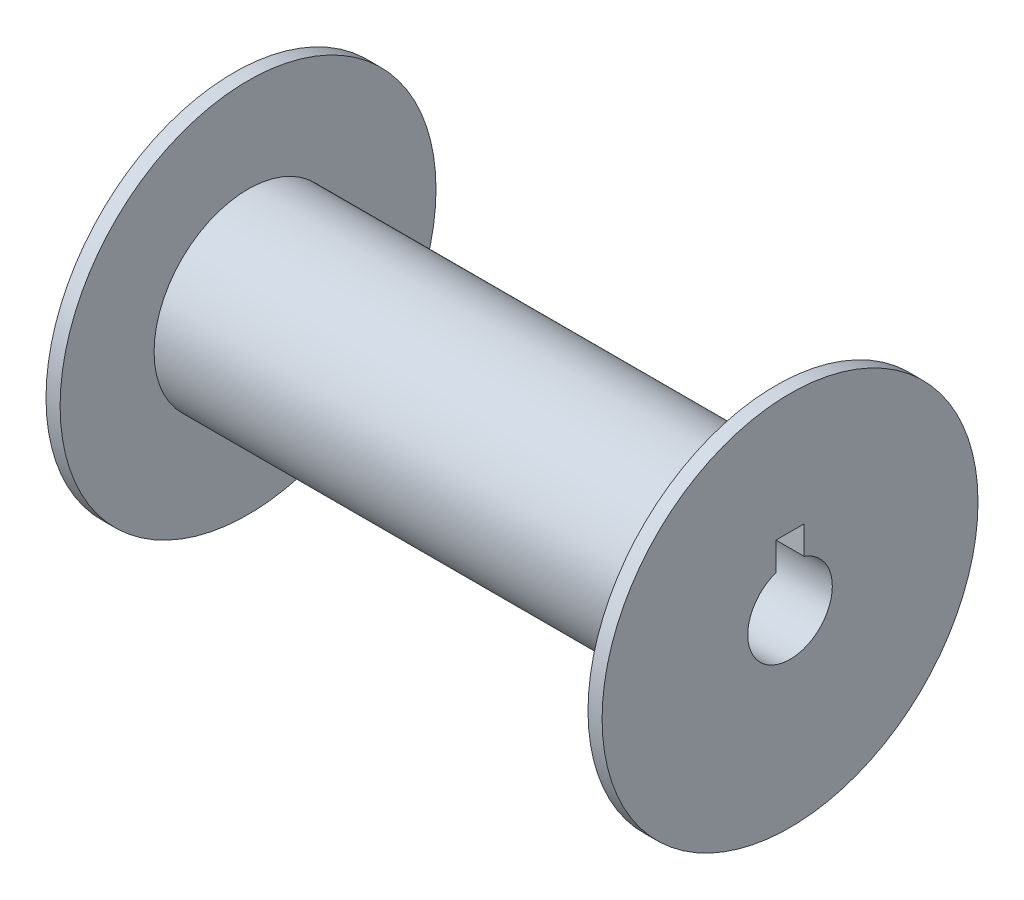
from build123d import *

# Parameters (mm, degrees)
SKETCH1_R           = 40
BOSS_EXTRUDE1_DEPTH = 118.35
SKETCH2_W           = 112.35
SKETCH2_H           = 20


with BuildPart() as part:
    # Sketch1 → Boss-Extrude1 (new body)
    with BuildSketch(Plane(origin=(0, 0, 0), x_dir=(0, 0, -1), z_dir=(1, 0, 0))):
        Circle(SKETCH1_R)
        with BuildLine():
            Line((-3, 8.485281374), (-3, 14.485281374))
            Line((-3, 14.485281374), (3, 14.485281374))
            Line((3, 14.485281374), (3, 8.485281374))
            ThreePointArc((3, 8.485281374), (0, -9), (-3, 8.485281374))
        make_face(mode=Mode.SUBTRACT)
    extrude(amount=BOSS_EXTRUDE1_DEPTH)

    # Sketch2 → Cut-Revolve1 (revolve, cut)
    with BuildSketch(Plane(origin=(0, 0, 0), x_dir=(1, 0, 0), z_dir=(0, 1, 0)), mode=Mode.PRIVATE) as cut_revolve1_sk:
        with Locations((59.175, 30)):
            Rectangle(SKETCH2_W, SKETCH2_H)
    revolve(cut_revolve1_sk.sketch.rotate(Axis((0, 0, 0), (1, 0, 0)), 180), axis=Axis((0, 0, 0), (1, 0, 0)), mode=Mode.SUBTRACT)


solid = part.part
